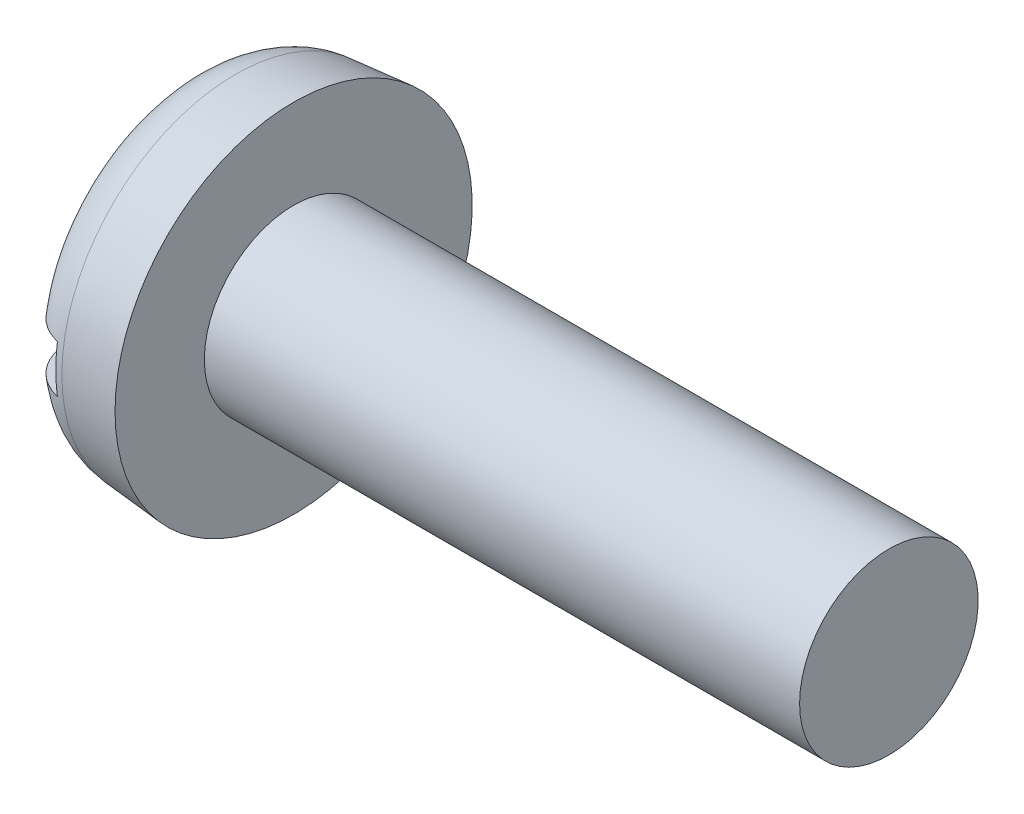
from build123d import *

# Parameters (mm, degrees)
FILLET2_R  = 1.8
SKETCH2_W  = 12
SKETCH2_H  = 1.6
SLOT_DEPTH = 1.4


with BuildPart() as part:
    # BodySke → Base-Revolve (revolve)
    with BuildSketch(Plane.XY, mode=Mode.PRIVATE) as base_revolve_sk:
        Polygon((3.6, 3), (3.6, 6), (0, 5.685040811), (0, 0), (23.6, 0), (23.6, 3), align=None)
    revolve(base_revolve_sk.sketch.rotate(Axis((-25.4, 0, 0), (1, 0, 0)), 90), axis=Axis((-25.4, 0, 0), (1, 0, 0)))

    # Fillet2
    fillet2_edges = [part.edges().sort_by_distance(p)[0] for p in [
        (0, 0, -5.685040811),
    ]]
    fillet(fillet2_edges, radius=FILLET2_R)

    # Sketch2 → Slot (cut)
    with BuildSketch(Plane(origin=(0, 0, 0), x_dir=(0, 0, -1), z_dir=(1, 0, 0))):
        Rectangle(SKETCH2_W, SKETCH2_H)
    extrude(amount=SLOT_DEPTH, mode=Mode.SUBTRACT)


solid = part.part
